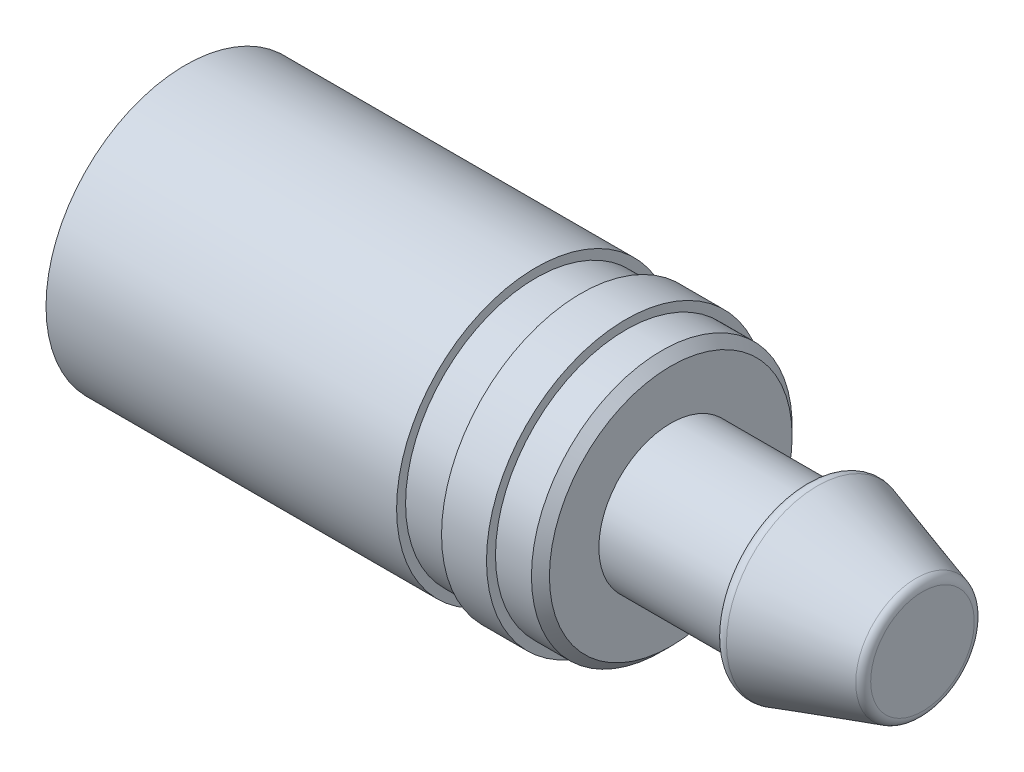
ISO-10303-21;
HEADER;
FILE_DESCRIPTION(('STEP AP214'),'2;1');
FILE_NAME('part.step','',(''),(''),'','','');
FILE_SCHEMA(('AUTOMOTIVE_DESIGN { 1 0 10303 214 1 1 1 1 }'));
ENDSEC;
DATA;
#1=APPLICATION_CONTEXT('core data for automotive mechanical design processes');
#2=APPLICATION_PROTOCOL_DEFINITION('international standard','automotive_design',2000,#1);
#3=PRODUCT_CONTEXT('',#1,'mechanical');
#4=PRODUCT('Part','Part','',(#3));
#5=PRODUCT_RELATED_PRODUCT_CATEGORY('part','',(#4));
#6=PRODUCT_DEFINITION_FORMATION('','',#4);
#7=PRODUCT_DEFINITION_CONTEXT('part definition',#1,'design');
#8=PRODUCT_DEFINITION('design','',#6,#7);
#9=PRODUCT_DEFINITION_SHAPE('','',#8);
#10=(LENGTH_UNIT() NAMED_UNIT(*) SI_UNIT(.MILLI.,.METRE.));
#11=(NAMED_UNIT(*) PLANE_ANGLE_UNIT() SI_UNIT($,.RADIAN.));
#12=(NAMED_UNIT(*) SI_UNIT($,.STERADIAN.) SOLID_ANGLE_UNIT());
#13=UNCERTAINTY_MEASURE_WITH_UNIT(LENGTH_MEASURE(1.E-05),#10,'distance_accuracy_value','');
#14=(GEOMETRIC_REPRESENTATION_CONTEXT(3) GLOBAL_UNCERTAINTY_ASSIGNED_CONTEXT((#13)) GLOBAL_UNIT_ASSIGNED_CONTEXT((#10,
#11,#12)) REPRESENTATION_CONTEXT('',''));
#15=CARTESIAN_POINT('',(0.,0.,0.));
#16=DIRECTION('',(0.,0.,1.));
#17=DIRECTION('',(1.,0.,0.));
#18=AXIS2_PLACEMENT_3D('',#15,#16,#17);
#19=CARTESIAN_POINT('',(82.,0.,0.));
#20=DIRECTION('',(-1.,0.,0.));
#21=DIRECTION('',(0.,0.,1.));
#22=AXIS2_PLACEMENT_3D('',#19,#20,#21);
#23=PLANE('',#22);
#24=CARTESIAN_POINT('',(82.,0.,0.));
#25=DIRECTION('',(-1.,0.,0.));
#26=DIRECTION('',(0.,0.,1.));
#27=AXIS2_PLACEMENT_3D('',#24,#25,#26);
#28=CIRCLE('',#27,5.76142534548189);
#29=CARTESIAN_POINT('',(82.,0.,5.76142534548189));
#30=VERTEX_POINT('',#29);
#31=EDGE_CURVE('E46',#30,#30,#28,.F.);
#32=ORIENTED_EDGE('',*,*,#31,.T.);
#33=EDGE_LOOP('',(#32));
#34=FACE_BOUND('',#33,.T.);
#35=ADVANCED_FACE('F31',(#34),#23,.F.);
#36=CARTESIAN_POINT('',(82.,0.,0.));
#37=DIRECTION('',(-1.,0.,0.));
#38=DIRECTION('',(0.,0.,1.));
#39=AXIS2_PLACEMENT_3D('',#36,#37,#38);
#40=CONICAL_SURFACE('',#39,6.5,0.298498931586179);
#41=CARTESIAN_POINT('',(81.2940858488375,0.,0.));
#42=DIRECTION('',(1.,0.,0.));
#43=DIRECTION('',(0.,0.,-1.));
#44=AXIS2_PLACEMENT_3D('',#41,#42,#43);
#45=CIRCLE('',#44,6.71720435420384);
#46=CARTESIAN_POINT('',(81.2940858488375,0.,-6.71720435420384));
#47=VERTEX_POINT('',#46);
#48=EDGE_CURVE('E51',#47,#47,#45,.F.);
#49=ORIENTED_EDGE('',*,*,#48,.T.);
#50=EDGE_LOOP('',(#49));
#51=FACE_BOUND('',#50,.T.);
#52=CARTESIAN_POINT('',(70.2940858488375,0.,0.));
#53=DIRECTION('',(1.,0.,0.));
#54=DIRECTION('',(0.,0.,-1.));
#55=AXIS2_PLACEMENT_3D('',#52,#53,#54);
#56=CIRCLE('',#55,10.1018197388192);
#57=CARTESIAN_POINT('',(70.2940858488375,0.,-10.1018197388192));
#58=VERTEX_POINT('',#57);
#59=EDGE_CURVE('E54',#58,#58,#56,.T.);
#60=ORIENTED_EDGE('',*,*,#59,.T.);
#61=EDGE_LOOP('',(#60));
#62=FACE_BOUND('',#61,.T.);
#63=ADVANCED_FACE('F133',(#51,#62),#40,.T.);
#64=CARTESIAN_POINT('',(69.,8.,0.));
#65=DIRECTION('',(1.,0.,0.));
#66=DIRECTION('',(0.,0.,-1.));
#67=AXIS2_PLACEMENT_3D('',#64,#65,#66);
#68=PLANE('',#67);
#69=CARTESIAN_POINT('',(69.,0.,0.));
#70=DIRECTION('',(1.,0.,0.));
#71=DIRECTION('',(0.,0.,-1.));
#72=AXIS2_PLACEMENT_3D('',#69,#70,#71);
#73=CIRCLE('',#72,9.14604073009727);
#74=CARTESIAN_POINT('',(69.,0.,-9.14604073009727));
#75=VERTEX_POINT('',#74);
#76=EDGE_CURVE('E42',#75,#75,#73,.F.);
#77=ORIENTED_EDGE('',*,*,#76,.T.);
#78=EDGE_LOOP('',(#77));
#79=FACE_BOUND('',#78,.T.);
#80=CARTESIAN_POINT('',(69.,0.,0.));
#81=DIRECTION('',(-1.,0.,0.));
#82=DIRECTION('',(0.,0.,1.));
#83=AXIS2_PLACEMENT_3D('',#80,#81,#82);
#84=CIRCLE('',#83,8.);
#85=CARTESIAN_POINT('',(69.,0.,8.));
#86=VERTEX_POINT('',#85);
#87=EDGE_CURVE('E57',#86,#86,#84,.T.);
#88=ORIENTED_EDGE('',*,*,#87,.F.);
#89=EDGE_LOOP('',(#88));
#90=FACE_BOUND('',#89,.T.);
#91=ADVANCED_FACE('F139',(#79,#90),#68,.F.);
#92=CARTESIAN_POINT('',(0.,0.,0.));
#93=DIRECTION('',(-1.,0.,0.));
#94=DIRECTION('',(0.,0.,1.));
#95=AXIS2_PLACEMENT_3D('',#92,#93,#94);
#96=CYLINDRICAL_SURFACE('',#95,8.);
#97=CARTESIAN_POINT('',(54.,0.,0.));
#98=DIRECTION('',(-1.,0.,0.));
#99=DIRECTION('',(0.,0.,1.));
#100=AXIS2_PLACEMENT_3D('',#97,#98,#99);
#101=CIRCLE('',#100,8.);
#102=CARTESIAN_POINT('',(54.,0.,8.));
#103=VERTEX_POINT('',#102);
#104=EDGE_CURVE('E60',#103,#103,#101,.T.);
#105=ORIENTED_EDGE('',*,*,#104,.F.);
#106=EDGE_LOOP('',(#105));
#107=FACE_BOUND('',#106,.T.);
#108=ORIENTED_EDGE('',*,*,#87,.T.);
#109=EDGE_LOOP('',(#108));
#110=FACE_BOUND('',#109,.T.);
#111=ADVANCED_FACE('F130',(#107,#110),#96,.T.);
#112=CARTESIAN_POINT('',(54.,14.5,0.));
#113=DIRECTION('',(-1.,0.,0.));
#114=DIRECTION('',(0.,0.,1.));
#115=AXIS2_PLACEMENT_3D('',#112,#113,#114);
#116=PLANE('',#115);
#117=CARTESIAN_POINT('',(54.,0.,0.));
#118=DIRECTION('',(-1.,0.,0.));
#119=DIRECTION('',(0.,0.,1.));
#120=AXIS2_PLACEMENT_3D('',#117,#118,#119);
#121=CIRCLE('',#120,13.5);
#122=CARTESIAN_POINT('',(54.,0.,13.5));
#123=VERTEX_POINT('',#122);
#124=EDGE_CURVE('E10',#123,#123,#121,.F.);
#125=ORIENTED_EDGE('',*,*,#124,.T.);
#126=EDGE_LOOP('',(#125));
#127=FACE_BOUND('',#126,.T.);
#128=ORIENTED_EDGE('',*,*,#104,.T.);
#129=EDGE_LOOP('',(#128));
#130=FACE_BOUND('',#129,.T.);
#131=ADVANCED_FACE('F125',(#127,#130),#116,.F.);
#132=CARTESIAN_POINT('',(0.,0.,0.));
#133=DIRECTION('',(-1.,0.,0.));
#134=DIRECTION('',(0.,0.,1.));
#135=AXIS2_PLACEMENT_3D('',#132,#133,#134);
#136=CYLINDRICAL_SURFACE('',#135,14.5);
#137=CARTESIAN_POINT('',(53.,0.,0.));
#138=DIRECTION('',(-1.,0.,0.));
#139=DIRECTION('',(0.,0.,1.));
#140=AXIS2_PLACEMENT_3D('',#137,#138,#139);
#141=CIRCLE('',#140,14.5);
#142=CARTESIAN_POINT('',(53.,0.,14.5));
#143=VERTEX_POINT('',#142);
#144=EDGE_CURVE('E38',#143,#143,#141,.T.);
#145=ORIENTED_EDGE('',*,*,#144,.T.);
#146=EDGE_LOOP('',(#145));
#147=FACE_BOUND('',#146,.T.);
#148=CARTESIAN_POINT('',(49.,0.,0.));
#149=DIRECTION('',(-1.,0.,0.));
#150=DIRECTION('',(0.,0.,1.));
#151=AXIS2_PLACEMENT_3D('',#148,#149,#150);
#152=CIRCLE('',#151,14.5);
#153=CARTESIAN_POINT('',(49.,0.,14.5));
#154=VERTEX_POINT('',#153);
#155=EDGE_CURVE('E63',#154,#154,#152,.T.);
#156=ORIENTED_EDGE('',*,*,#155,.F.);
#157=EDGE_LOOP('',(#156));
#158=FACE_BOUND('',#157,.T.);
#159=ADVANCED_FACE('F120',(#147,#158),#136,.T.);
#160=CARTESIAN_POINT('',(49.,15.5,0.));
#161=DIRECTION('',(-1.,0.,0.));
#162=DIRECTION('',(0.,0.,1.));
#163=AXIS2_PLACEMENT_3D('',#160,#161,#162);
#164=PLANE('',#163);
#165=CARTESIAN_POINT('',(49.,0.,0.));
#166=DIRECTION('',(-1.,0.,0.));
#167=DIRECTION('',(0.,0.,1.));
#168=AXIS2_PLACEMENT_3D('',#165,#166,#167);
#169=CIRCLE('',#168,15.5);
#170=CARTESIAN_POINT('',(49.,0.,15.5));
#171=VERTEX_POINT('',#170);
#172=EDGE_CURVE('E66',#171,#171,#169,.T.);
#173=ORIENTED_EDGE('',*,*,#172,.F.);
#174=EDGE_LOOP('',(#173));
#175=FACE_BOUND('',#174,.T.);
#176=ORIENTED_EDGE('',*,*,#155,.T.);
#177=EDGE_LOOP('',(#176));
#178=FACE_BOUND('',#177,.T.);
#179=ADVANCED_FACE('F114',(#175,#178),#164,.F.);
#180=CARTESIAN_POINT('',(0.,0.,0.));
#181=DIRECTION('',(-1.,0.,0.));
#182=DIRECTION('',(0.,0.,1.));
#183=AXIS2_PLACEMENT_3D('',#180,#181,#182);
#184=CYLINDRICAL_SURFACE('',#183,15.5);
#185=CARTESIAN_POINT('',(44.,0.,0.));
#186=DIRECTION('',(-1.,0.,0.));
#187=DIRECTION('',(0.,0.,1.));
#188=AXIS2_PLACEMENT_3D('',#185,#186,#187);
#189=CIRCLE('',#188,15.5);
#190=CARTESIAN_POINT('',(44.,0.,15.5));
#191=VERTEX_POINT('',#190);
#192=EDGE_CURVE('E69',#191,#191,#189,.T.);
#193=ORIENTED_EDGE('',*,*,#192,.F.);
#194=EDGE_LOOP('',(#193));
#195=FACE_BOUND('',#194,.T.);
#196=ORIENTED_EDGE('',*,*,#172,.T.);
#197=EDGE_LOOP('',(#196));
#198=FACE_BOUND('',#197,.T.);
#199=ADVANCED_FACE('F108',(#195,#198),#184,.T.);
#200=CARTESIAN_POINT('',(44.,14.5,0.));
#201=DIRECTION('',(1.,0.,0.));
#202=DIRECTION('',(0.,0.,-1.));
#203=AXIS2_PLACEMENT_3D('',#200,#201,#202);
#204=PLANE('',#203);
#205=CARTESIAN_POINT('',(44.,0.,0.));
#206=DIRECTION('',(-1.,0.,0.));
#207=DIRECTION('',(0.,0.,1.));
#208=AXIS2_PLACEMENT_3D('',#205,#206,#207);
#209=CIRCLE('',#208,14.5);
#210=CARTESIAN_POINT('',(44.,0.,14.5));
#211=VERTEX_POINT('',#210);
#212=EDGE_CURVE('E72',#211,#211,#209,.T.);
#213=ORIENTED_EDGE('',*,*,#212,.F.);
#214=EDGE_LOOP('',(#213));
#215=FACE_BOUND('',#214,.T.);
#216=ORIENTED_EDGE('',*,*,#192,.T.);
#217=EDGE_LOOP('',(#216));
#218=FACE_BOUND('',#217,.T.);
#219=ADVANCED_FACE('F102',(#215,#218),#204,.F.);
#220=CARTESIAN_POINT('',(0.,0.,0.));
#221=DIRECTION('',(-1.,0.,0.));
#222=DIRECTION('',(0.,0.,1.));
#223=AXIS2_PLACEMENT_3D('',#220,#221,#222);
#224=CYLINDRICAL_SURFACE('',#223,14.5);
#225=CARTESIAN_POINT('',(39.,0.,0.));
#226=DIRECTION('',(-1.,0.,0.));
#227=DIRECTION('',(0.,0.,1.));
#228=AXIS2_PLACEMENT_3D('',#225,#226,#227);
#229=CIRCLE('',#228,14.5);
#230=CARTESIAN_POINT('',(39.,0.,14.5));
#231=VERTEX_POINT('',#230);
#232=EDGE_CURVE('E75',#231,#231,#229,.T.);
#233=ORIENTED_EDGE('',*,*,#232,.F.);
#234=EDGE_LOOP('',(#233));
#235=FACE_BOUND('',#234,.T.);
#236=ORIENTED_EDGE('',*,*,#212,.T.);
#237=EDGE_LOOP('',(#236));
#238=FACE_BOUND('',#237,.T.);
#239=ADVANCED_FACE('F96',(#235,#238),#224,.T.);
#240=CARTESIAN_POINT('',(39.,15.5,0.));
#241=DIRECTION('',(-1.,0.,0.));
#242=DIRECTION('',(0.,0.,1.));
#243=AXIS2_PLACEMENT_3D('',#240,#241,#242);
#244=PLANE('',#243);
#245=CARTESIAN_POINT('',(39.,0.,0.));
#246=DIRECTION('',(-1.,0.,0.));
#247=DIRECTION('',(0.,0.,1.));
#248=AXIS2_PLACEMENT_3D('',#245,#246,#247);
#249=CIRCLE('',#248,15.5);
#250=CARTESIAN_POINT('',(39.,0.,15.5));
#251=VERTEX_POINT('',#250);
#252=EDGE_CURVE('E78',#251,#251,#249,.T.);
#253=ORIENTED_EDGE('',*,*,#252,.F.);
#254=EDGE_LOOP('',(#253));
#255=FACE_BOUND('',#254,.T.);
#256=ORIENTED_EDGE('',*,*,#232,.T.);
#257=EDGE_LOOP('',(#256));
#258=FACE_BOUND('',#257,.T.);
#259=ADVANCED_FACE('F90',(#255,#258),#244,.F.);
#260=CARTESIAN_POINT('',(0.,0.,0.));
#261=DIRECTION('',(-1.,0.,0.));
#262=DIRECTION('',(0.,0.,1.));
#263=AXIS2_PLACEMENT_3D('',#260,#261,#262);
#264=CYLINDRICAL_SURFACE('',#263,15.5);
#265=CARTESIAN_POINT('',(0.,0.,0.));
#266=DIRECTION('',(-1.,0.,0.));
#267=DIRECTION('',(0.,0.,1.));
#268=AXIS2_PLACEMENT_3D('',#265,#266,#267);
#269=CIRCLE('',#268,15.5);
#270=CARTESIAN_POINT('',(0.,0.,15.5));
#271=VERTEX_POINT('',#270);
#272=EDGE_CURVE('E81',#271,#271,#269,.T.);
#273=ORIENTED_EDGE('',*,*,#272,.F.);
#274=EDGE_LOOP('',(#273));
#275=FACE_BOUND('',#274,.T.);
#276=ORIENTED_EDGE('',*,*,#252,.T.);
#277=EDGE_LOOP('',(#276));
#278=FACE_BOUND('',#277,.T.);
#279=ADVANCED_FACE('F87',(#275,#278),#264,.T.);
#280=CARTESIAN_POINT('',(0.,0.,0.));
#281=DIRECTION('',(1.,0.,0.));
#282=DIRECTION('',(0.,0.,-1.));
#283=AXIS2_PLACEMENT_3D('',#280,#281,#282);
#284=PLANE('',#283);
#285=ORIENTED_EDGE('',*,*,#272,.T.);
#286=EDGE_LOOP('',(#285));
#287=FACE_BOUND('',#286,.T.);
#288=ADVANCED_FACE('F85',(#287),#284,.F.);
#289=CARTESIAN_POINT('',(81.,0.,0.));
#290=DIRECTION('',(-1.,0.,0.));
#291=DIRECTION('',(0.,0.,1.));
#292=AXIS2_PLACEMENT_3D('',#289,#290,#291);
#293=TOROIDAL_SURFACE('',#292,5.76142534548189,1.);
#294=ORIENTED_EDGE('',*,*,#31,.F.);
#295=EDGE_LOOP('',(#294));
#296=FACE_BOUND('',#295,.T.);
#297=ORIENTED_EDGE('',*,*,#48,.F.);
#298=EDGE_LOOP('',(#297));
#299=FACE_BOUND('',#298,.T.);
#300=ADVANCED_FACE('F144',(#296,#299),#293,.T.);
#301=CARTESIAN_POINT('',(70.,0.,0.));
#302=DIRECTION('',(1.,0.,0.));
#303=DIRECTION('',(0.,0.,-1.));
#304=AXIS2_PLACEMENT_3D('',#301,#302,#303);
#305=TOROIDAL_SURFACE('',#304,9.14604073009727,1.);
#306=ORIENTED_EDGE('',*,*,#59,.F.);
#307=EDGE_LOOP('',(#306));
#308=FACE_BOUND('',#307,.T.);
#309=ORIENTED_EDGE('',*,*,#76,.F.);
#310=EDGE_LOOP('',(#309));
#311=FACE_BOUND('',#310,.T.);
#312=ADVANCED_FACE('F146',(#308,#311),#305,.T.);
#313=CARTESIAN_POINT('',(53.,0.,0.));
#314=DIRECTION('',(-1.,0.,0.));
#315=DIRECTION('',(0.,0.,1.));
#316=AXIS2_PLACEMENT_3D('',#313,#314,#315);
#317=CONICAL_SURFACE('',#316,14.5,0.785398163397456);
#318=ORIENTED_EDGE('',*,*,#124,.F.);
#319=EDGE_LOOP('',(#318));
#320=FACE_BOUND('',#319,.T.);
#321=ORIENTED_EDGE('',*,*,#144,.F.);
#322=EDGE_LOOP('',(#321));
#323=FACE_BOUND('',#322,.T.);
#324=ADVANCED_FACE('F33',(#320,#323),#317,.T.);
#325=CLOSED_SHELL('',(#35,#63,#91,#111,#131,#159,#179,#199,#219,#239,#259,#279,#288,#300,#312,#324));
#326=MANIFOLD_SOLID_BREP('B2',#325);
#327=ADVANCED_BREP_SHAPE_REPRESENTATION('',(#18,#326),#14);
#328=SHAPE_DEFINITION_REPRESENTATION(#9,#327);
ENDSEC;
END-ISO-10303-21;
